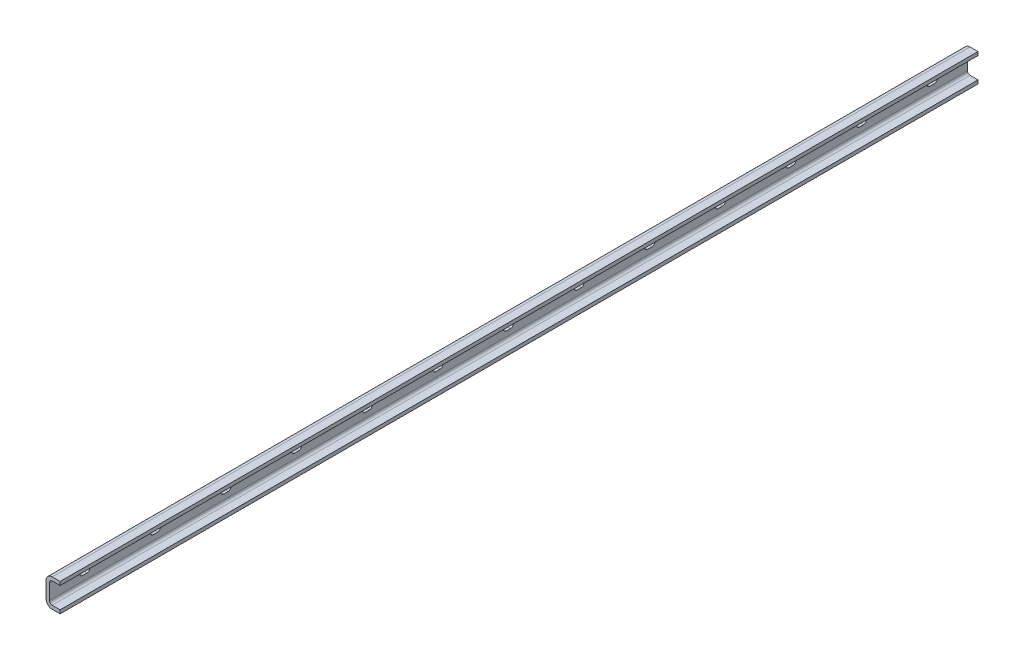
from build123d import *

# Parameters (mm, degrees)
EXTRUDE1_DEPTH  = 1040
EXTRUDE2_DEPTH  = 1041.190756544
LPATTERN1_COUNT = 13
LPATTERN1_PITCH = 80


with BuildPart() as part:
    # Sketch1 → Extrude1 (new body)
    with BuildSketch(Plane.XY):
        with BuildLine():
            Line((16, 11.9), (16, 15.9))
            Line((16, 15.9), (7, 15.9))
            ThreePointArc((7, 15.9), (2.050252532, 13.849747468), (0, 8.9))
            Line((0, 8.9), (0, -8.9))
            ThreePointArc((0, -8.9), (2.050252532, -13.849747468), (7, -15.9))
            Line((7, -15.9), (16, -15.9))
            Line((16, -15.9), (16, -11.9))
            Line((16, -11.9), (7, -11.9))
            ThreePointArc((7, -11.9), (4.878679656, -11.021320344), (4, -8.9))
            Line((4, -8.9), (4, 8.9))
            ThreePointArc((4, 8.9), (4.878679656, 11.021320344), (7, 11.9))
            Line((7, 11.9), (16, 11.9))
        make_face()
    extrude(amount=-EXTRUDE1_DEPTH)

    # Sketch2 → Extrude2 (cut, through all)
    with BuildSketch(Plane(origin=(4, 0, 0), x_dir=(0, 0, -1), z_dir=(1, 0, 0))):
        with BuildLine():
            Line((37.5, 3), (42.5, 3))
            ThreePointArc((42.5, 3), (45.5, 0), (42.5, -3))
            Line((42.5, -3), (37.5, -3))
            ThreePointArc((37.5, -3), (34.5, 0), (37.5, 3))
        make_face()
    extrude2 = extrude(amount=-EXTRUDE2_DEPTH, mode=Mode.SUBTRACT)

    # LPattern1: Extrude2 ×13
    with Locations(*[(0, 0, -i * LPATTERN1_PITCH) for i in range(1, LPATTERN1_COUNT)]):
        add(extrude2, mode=Mode.SUBTRACT)


solid = part.part
